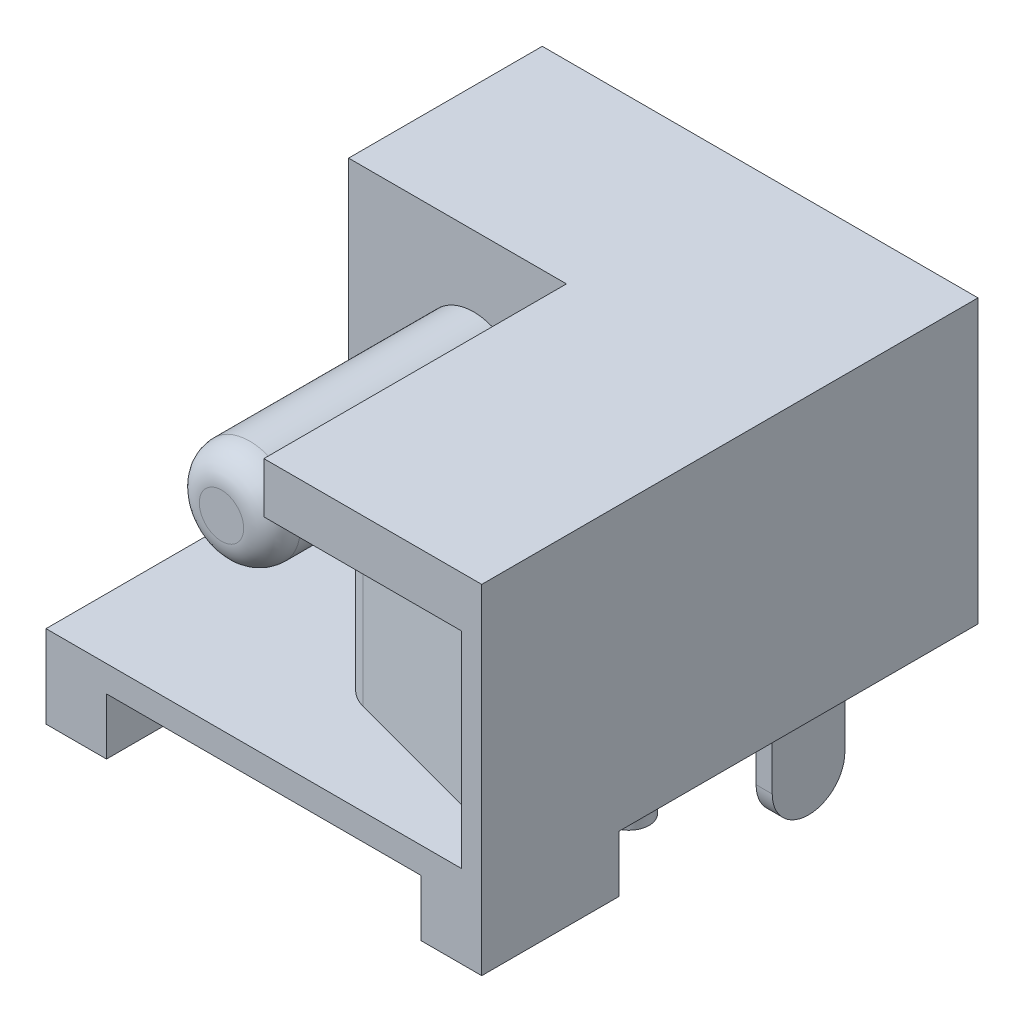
ISO-10303-21;
HEADER;
FILE_DESCRIPTION(('STEP AP214'),'2;1');
FILE_NAME('part.step','',(''),(''),'','','');
FILE_SCHEMA(('AUTOMOTIVE_DESIGN { 1 0 10303 214 1 1 1 1 }'));
ENDSEC;
DATA;
#1=APPLICATION_CONTEXT('core data for automotive mechanical design processes');
#2=APPLICATION_PROTOCOL_DEFINITION('international standard','automotive_design',2000,#1);
#3=PRODUCT_CONTEXT('',#1,'mechanical');
#4=PRODUCT('Part','Part','',(#3));
#5=PRODUCT_RELATED_PRODUCT_CATEGORY('part','',(#4));
#6=PRODUCT_DEFINITION_FORMATION('','',#4);
#7=PRODUCT_DEFINITION_CONTEXT('part definition',#1,'design');
#8=PRODUCT_DEFINITION('design','',#6,#7);
#9=PRODUCT_DEFINITION_SHAPE('','',#8);
#10=(LENGTH_UNIT() NAMED_UNIT(*) SI_UNIT(.MILLI.,.METRE.));
#11=(NAMED_UNIT(*) PLANE_ANGLE_UNIT() SI_UNIT($,.RADIAN.));
#12=(NAMED_UNIT(*) SI_UNIT($,.STERADIAN.) SOLID_ANGLE_UNIT());
#13=UNCERTAINTY_MEASURE_WITH_UNIT(LENGTH_MEASURE(1.E-05),#10,'distance_accuracy_value','');
#14=(GEOMETRIC_REPRESENTATION_CONTEXT(3) GLOBAL_UNCERTAINTY_ASSIGNED_CONTEXT((#13)) GLOBAL_UNIT_ASSIGNED_CONTEXT((#10,
#11,#12)) REPRESENTATION_CONTEXT('',''));
#15=CARTESIAN_POINT('',(0.,0.,0.));
#16=DIRECTION('',(0.,0.,1.));
#17=DIRECTION('',(1.,0.,0.));
#18=AXIS2_PLACEMENT_3D('',#15,#16,#17);
#19=CARTESIAN_POINT('',(-5.4,0.800000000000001,-12.3));
#20=DIRECTION('',(0.,0.,1.));
#21=DIRECTION('',(1.,0.,0.));
#22=AXIS2_PLACEMENT_3D('',#19,#20,#21);
#23=PLANE('',#22);
#24=DIRECTION('',(1.,0.,0.));
#25=VECTOR('',#24,1.);
#26=CARTESIAN_POINT('',(-5.4,0.800000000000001,-12.3));
#27=LINE('',#26,#25);
#28=CARTESIAN_POINT('',(-5.4,0.8,-12.3));
#29=VERTEX_POINT('',#28);
#30=CARTESIAN_POINT('',(5.4,0.799999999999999,-12.3));
#31=VERTEX_POINT('',#30);
#32=EDGE_CURVE('E361',#29,#31,#27,.T.);
#33=ORIENTED_EDGE('',*,*,#32,.F.);
#34=DIRECTION('',(0.,1.,0.));
#35=VECTOR('',#34,1.);
#36=CARTESIAN_POINT('',(-5.4,0.800000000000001,-12.3));
#37=LINE('',#36,#35);
#38=CARTESIAN_POINT('',(-5.4,7.8,-12.3));
#39=VERTEX_POINT('',#38);
#40=EDGE_CURVE('E465',#39,#29,#37,.F.);
#41=ORIENTED_EDGE('',*,*,#40,.F.);
#42=DIRECTION('',(1.,0.,0.));
#43=VECTOR('',#42,1.);
#44=CARTESIAN_POINT('',(-5.4,7.8,-12.3));
#45=LINE('',#44,#43);
#46=CARTESIAN_POINT('',(5.4,7.8,-12.3));
#47=VERTEX_POINT('',#46);
#48=EDGE_CURVE('E462',#47,#39,#45,.F.);
#49=ORIENTED_EDGE('',*,*,#48,.F.);
#50=DIRECTION('',(0.,1.,0.));
#51=VECTOR('',#50,1.);
#52=CARTESIAN_POINT('',(5.4,0.8,-12.3));
#53=LINE('',#52,#51);
#54=EDGE_CURVE('E466',#31,#47,#53,.T.);
#55=ORIENTED_EDGE('',*,*,#54,.F.);
#56=EDGE_LOOP('',(#33,#41,#49,#55));
#57=FACE_BOUND('',#56,.T.);
#58=ADVANCED_FACE('F30',(#57),#23,.F.);
#59=CARTESIAN_POINT('',(-2.3,4.8,-1.25));
#60=DIRECTION('',(0.,0.,1.));
#61=DIRECTION('',(1.,0.,0.));
#62=AXIS2_PLACEMENT_3D('',#59,#60,#61);
#63=PLANE('',#62);
#64=CARTESIAN_POINT('',(-2.3,4.8,-1.25));
#65=DIRECTION('',(0.,0.,-1.));
#66=DIRECTION('',(-1.,0.,0.));
#67=AXIS2_PLACEMENT_3D('',#64,#65,#66);
#68=CIRCLE('',#67,0.55);
#69=CARTESIAN_POINT('',(-2.85,4.8,-1.25));
#70=VERTEX_POINT('',#69);
#71=CARTESIAN_POINT('',(-1.75,4.8,-1.25));
#72=VERTEX_POINT('',#71);
#73=EDGE_CURVE('E688',#70,#72,#68,.T.);
#74=ORIENTED_EDGE('',*,*,#73,.F.);
#75=CARTESIAN_POINT('',(-2.3,4.8,-1.25));
#76=DIRECTION('',(0.,0.,-1.));
#77=DIRECTION('',(1.,0.,0.));
#78=AXIS2_PLACEMENT_3D('',#75,#76,#77);
#79=CIRCLE('',#78,0.55);
#80=EDGE_CURVE('E689',#72,#70,#79,.T.);
#81=ORIENTED_EDGE('',*,*,#80,.F.);
#82=EDGE_LOOP('',(#74,#81));
#83=FACE_BOUND('',#82,.T.);
#84=ADVANCED_FACE('F32',(#83),#63,.T.);
#85=CARTESIAN_POINT('',(0.46155033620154,1.45,-3.22455518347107));
#86=DIRECTION('',(0.,1.,0.));
#87=DIRECTION('',(0.,0.,-1.));
#88=AXIS2_PLACEMENT_3D('',#85,#86,#87);
#89=CYLINDRICAL_SURFACE('',#88,1.);
#90=CARTESIAN_POINT('',(0.46155033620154,6.55,-3.22455518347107));
#91=DIRECTION('',(0.,1.,0.));
#92=DIRECTION('',(0.,0.,-1.));
#93=AXIS2_PLACEMENT_3D('',#90,#91,#92);
#94=CIRCLE('',#93,1.);
#95=CARTESIAN_POINT('',(-0.523257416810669,6.55,-3.398203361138));
#96=VERTEX_POINT('',#95);
#97=CARTESIAN_POINT('',(0.,6.55,-2.33744116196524));
#98=VERTEX_POINT('',#97);
#99=EDGE_CURVE('E194',#96,#98,#94,.T.);
#100=ORIENTED_EDGE('',*,*,#99,.F.);
#101=DIRECTION('',(0.,1.,0.));
#102=VECTOR('',#101,1.);
#103=CARTESIAN_POINT('',(-0.523257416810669,1.45,-3.398203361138));
#104=LINE('',#103,#102);
#105=CARTESIAN_POINT('',(-0.523257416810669,1.45,-3.398203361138));
#106=VERTEX_POINT('',#105);
#107=EDGE_CURVE('E181',#106,#96,#104,.T.);
#108=ORIENTED_EDGE('',*,*,#107,.F.);
#109=CARTESIAN_POINT('',(0.46155033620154,1.45,-3.22455518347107));
#110=DIRECTION('',(0.,1.,0.));
#111=DIRECTION('',(0.,0.,-1.));
#112=AXIS2_PLACEMENT_3D('',#109,#110,#111);
#113=CIRCLE('',#112,1.);
#114=CARTESIAN_POINT('',(0.202731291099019,1.45,-2.258629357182));
#115=VERTEX_POINT('',#114);
#116=EDGE_CURVE('E175',#106,#115,#113,.T.);
#117=ORIENTED_EDGE('',*,*,#116,.T.);
#118=DIRECTION('',(0.,1.,0.));
#119=VECTOR('',#118,1.);
#120=CARTESIAN_POINT('',(0.202731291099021,6.55,-2.258629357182));
#121=LINE('',#120,#119);
#122=CARTESIAN_POINT('',(0.202731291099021,6.55,-2.258629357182));
#123=VERTEX_POINT('',#122);
#124=EDGE_CURVE('E178',#123,#115,#121,.F.);
#125=ORIENTED_EDGE('',*,*,#124,.F.);
#126=CARTESIAN_POINT('',(0.46155033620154,6.55,-3.22455518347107));
#127=DIRECTION('',(0.,1.,0.));
#128=DIRECTION('',(0.,0.,-1.));
#129=AXIS2_PLACEMENT_3D('',#126,#127,#128);
#130=CIRCLE('',#129,1.);
#131=EDGE_CURVE('E185',#123,#98,#130,.F.);
#132=ORIENTED_EDGE('',*,*,#131,.T.);
#133=EDGE_LOOP('',(#100,#108,#117,#125,#132));
#134=FACE_BOUND('',#133,.T.);
#135=ADVANCED_FACE('F177',(#134),#89,.T.);
#136=CARTESIAN_POINT('',(-1.75,4.8,-1.95));
#137=DIRECTION('',(0.,1.,0.));
#138=DIRECTION('',(1.,0.,0.));
#139=AXIS2_PLACEMENT_3D('',#136,#137,#138);
#140=CIRCLE('',#139,0.7);
#141=TRIMMED_CURVE('',#140,(PARAMETER_VALUE(-2.47464630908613)),
(PARAMETER_VALUE(2.47464630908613)),.T.,.PARAMETER.);
#142=CARTESIAN_POINT('',(-2.3,4.8,-1.95));
#143=DIRECTION('',(0.,0.,1.));
#144=AXIS1_PLACEMENT('',#142,#143);
#145=SURFACE_OF_REVOLUTION('',#141,#144);
#146=ORIENTED_EDGE('',*,*,#80,.T.);
#147=ORIENTED_EDGE('',*,*,#73,.T.);
#148=EDGE_LOOP('',(#146,#147));
#149=FACE_BOUND('',#148,.T.);
#150=CARTESIAN_POINT('',(-2.3,4.8,-1.95));
#151=DIRECTION('',(0.,0.,-1.));
#152=DIRECTION('',(-1.,0.,0.));
#153=AXIS2_PLACEMENT_3D('',#150,#151,#152);
#154=CIRCLE('',#153,1.25);
#155=CARTESIAN_POINT('',(-3.55,4.8,-1.95));
#156=VERTEX_POINT('',#155);
#157=EDGE_CURVE('E290',#156,#156,#154,.T.);
#158=ORIENTED_EDGE('',*,*,#157,.F.);
#159=EDGE_LOOP('',(#158));
#160=FACE_BOUND('',#159,.T.);
#161=ADVANCED_FACE('F324',(#149,#160),#145,.F.);
#162=CARTESIAN_POINT('',(0.200000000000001,6.55,-7.5));
#163=DIRECTION('',(0.,1.,0.));
#164=DIRECTION('',(0.,0.,-1.));
#165=AXIS2_PLACEMENT_3D('',#162,#163,#164);
#166=PLANE('',#165);
#167=ORIENTED_EDGE('',*,*,#99,.T.);
#168=DIRECTION('',(0.,0.,1.));
#169=VECTOR('',#168,1.);
#170=CARTESIAN_POINT('',(0.,6.55,-7.5));
#171=LINE('',#170,#169);
#172=CARTESIAN_POINT('',(0.,6.55,-6.36574363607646));
#173=VERTEX_POINT('',#172);
#174=EDGE_CURVE('E286',#98,#173,#171,.F.);
#175=ORIENTED_EDGE('',*,*,#174,.T.);
#176=DIRECTION('',(-0.173648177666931,0.,0.984807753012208));
#177=VECTOR('',#176,1.);
#178=CARTESIAN_POINT('',(0.200000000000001,6.55,-7.5));
#179=LINE('',#178,#177);
#180=EDGE_CURVE('E260',#96,#173,#179,.F.);
#181=ORIENTED_EDGE('',*,*,#180,.F.);
#182=EDGE_LOOP('',(#167,#175,#181));
#183=FACE_BOUND('',#182,.T.);
#184=ADVANCED_FACE('F328',(#183),#166,.T.);
#185=CARTESIAN_POINT('',(4.9,6.55,-1.));
#186=DIRECTION('',(-0.258819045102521,0.,0.965925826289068));
#187=DIRECTION('',(0.965925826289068,0.,0.258819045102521));
#188=AXIS2_PLACEMENT_3D('',#185,#186,#187);
#189=PLANE('',#188);
#190=DIRECTION('',(0.965925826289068,0.,0.258819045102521));
#191=VECTOR('',#190,1.);
#192=CARTESIAN_POINT('',(0.202731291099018,1.45,-2.258629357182));
#193=LINE('',#192,#191);
#194=CARTESIAN_POINT('',(4.9,1.45,-1.));
#195=VERTEX_POINT('',#194);
#196=EDGE_CURVE('E191',#115,#195,#193,.T.);
#197=ORIENTED_EDGE('',*,*,#196,.T.);
#198=DIRECTION('',(0.,1.,0.));
#199=VECTOR('',#198,1.);
#200=CARTESIAN_POINT('',(4.9,6.55,-1.));
#201=LINE('',#200,#199);
#202=CARTESIAN_POINT('',(4.9,6.55,-1.));
#203=VERTEX_POINT('',#202);
#204=EDGE_CURVE('E205',#195,#203,#201,.T.);
#205=ORIENTED_EDGE('',*,*,#204,.T.);
#206=DIRECTION('',(-0.965925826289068,0.,-0.258819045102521));
#207=VECTOR('',#206,1.);
#208=CARTESIAN_POINT('',(4.9,6.55,-1.));
#209=LINE('',#208,#207);
#210=EDGE_CURVE('E193',#203,#123,#209,.T.);
#211=ORIENTED_EDGE('',*,*,#210,.T.);
#212=ORIENTED_EDGE('',*,*,#124,.T.);
#213=EDGE_LOOP('',(#197,#205,#211,#212));
#214=FACE_BOUND('',#213,.T.);
#215=ADVANCED_FACE('F189',(#214),#189,.T.);
#216=CARTESIAN_POINT('',(0.199999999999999,1.45,-7.5));
#217=DIRECTION('',(-0.984807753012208,0.,-0.173648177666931));
#218=DIRECTION('',(-0.173648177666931,0.,0.984807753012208));
#219=AXIS2_PLACEMENT_3D('',#216,#217,#218);
#220=PLANE('',#219);
#221=DIRECTION('',(0.173648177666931,0.,-0.984807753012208));
#222=VECTOR('',#221,1.);
#223=CARTESIAN_POINT('',(0.,6.55,-6.36574363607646));
#224=LINE('',#223,#222);
#225=CARTESIAN_POINT('',(0.200000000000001,6.55,-7.5));
#226=VERTEX_POINT('',#225);
#227=EDGE_CURVE('E310',#173,#226,#224,.T.);
#228=ORIENTED_EDGE('',*,*,#227,.T.);
#229=DIRECTION('',(0.,1.,0.));
#230=VECTOR('',#229,1.);
#231=CARTESIAN_POINT('',(0.199999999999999,1.45,-7.5));
#232=LINE('',#231,#230);
#233=CARTESIAN_POINT('',(0.200000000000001,1.45,-7.5));
#234=VERTEX_POINT('',#233);
#235=EDGE_CURVE('E261',#234,#226,#232,.T.);
#236=ORIENTED_EDGE('',*,*,#235,.F.);
#237=DIRECTION('',(-0.173648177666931,0.,0.984807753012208));
#238=VECTOR('',#237,1.);
#239=CARTESIAN_POINT('',(0.199999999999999,1.45,-7.5));
#240=LINE('',#239,#238);
#241=EDGE_CURVE('E201',#234,#106,#240,.T.);
#242=ORIENTED_EDGE('',*,*,#241,.T.);
#243=ORIENTED_EDGE('',*,*,#107,.T.);
#244=ORIENTED_EDGE('',*,*,#180,.T.);
#245=EDGE_LOOP('',(#228,#236,#242,#243,#244));
#246=FACE_BOUND('',#245,.T.);
#247=ADVANCED_FACE('F754',(#246),#220,.T.);
#248=CARTESIAN_POINT('',(0.200000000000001,6.55,-7.5));
#249=DIRECTION('',(0.,1.,0.));
#250=DIRECTION('',(0.,0.,-1.));
#251=AXIS2_PLACEMENT_3D('',#248,#249,#250);
#252=PLANE('',#251);
#253=DIRECTION('',(0.,0.,1.));
#254=VECTOR('',#253,1.);
#255=CARTESIAN_POINT('',(0.,6.55,-7.5));
#256=LINE('',#255,#254);
#257=CARTESIAN_POINT('',(0.,6.55,-7.5));
#258=VERTEX_POINT('',#257);
#259=EDGE_CURVE('E289',#173,#258,#256,.F.);
#260=ORIENTED_EDGE('',*,*,#259,.T.);
#261=DIRECTION('',(1.,0.,0.));
#262=VECTOR('',#261,1.);
#263=CARTESIAN_POINT('',(-5.4,6.55,-7.5));
#264=LINE('',#263,#262);
#265=EDGE_CURVE('E264',#226,#258,#264,.F.);
#266=ORIENTED_EDGE('',*,*,#265,.F.);
#267=ORIENTED_EDGE('',*,*,#227,.F.);
#268=EDGE_LOOP('',(#260,#266,#267));
#269=FACE_BOUND('',#268,.T.);
#270=ADVANCED_FACE('F720',(#269),#252,.F.);
#271=CARTESIAN_POINT('',(-2.3,4.8,-1.25));
#272=DIRECTION('',(0.,0.,-1.));
#273=DIRECTION('',(-1.,0.,0.));
#274=AXIS2_PLACEMENT_3D('',#271,#272,#273);
#275=CYLINDRICAL_SURFACE('',#274,1.25);
#276=CARTESIAN_POINT('',(-2.3,4.8,-7.5));
#277=DIRECTION('',(0.,0.,-1.));
#278=DIRECTION('',(-1.,0.,0.));
#279=AXIS2_PLACEMENT_3D('',#276,#277,#278);
#280=CIRCLE('',#279,1.25);
#281=CARTESIAN_POINT('',(-3.55,4.8,-7.5));
#282=VERTEX_POINT('',#281);
#283=EDGE_CURVE('E300',#282,#282,#280,.T.);
#284=ORIENTED_EDGE('',*,*,#283,.F.);
#285=EDGE_LOOP('',(#284));
#286=FACE_BOUND('',#285,.T.);
#287=ORIENTED_EDGE('',*,*,#157,.T.);
#288=EDGE_LOOP('',(#287));
#289=FACE_BOUND('',#288,.T.);
#290=ADVANCED_FACE('F870',(#286,#289),#275,.T.);
#291=CARTESIAN_POINT('',(0.,7.8,-7.5));
#292=DIRECTION('',(1.,0.,0.));
#293=DIRECTION('',(0.,1.,0.));
#294=AXIS2_PLACEMENT_3D('',#291,#292,#293);
#295=PLANE('',#294);
#296=DIRECTION('',(0.,1.,0.));
#297=VECTOR('',#296,1.);
#298=CARTESIAN_POINT('',(0.,7.8,0.));
#299=LINE('',#298,#297);
#300=CARTESIAN_POINT('',(0.,7.8,0.));
#301=VERTEX_POINT('',#300);
#302=CARTESIAN_POINT('',(0.,6.55,0.));
#303=VERTEX_POINT('',#302);
#304=EDGE_CURVE('E246',#301,#303,#299,.F.);
#305=ORIENTED_EDGE('',*,*,#304,.F.);
#306=DIRECTION('',(0.,0.,1.));
#307=VECTOR('',#306,1.);
#308=CARTESIAN_POINT('',(0.,7.8,-12.3));
#309=LINE('',#308,#307);
#310=CARTESIAN_POINT('',(0.,7.8,-7.5));
#311=VERTEX_POINT('',#310);
#312=EDGE_CURVE('E296',#311,#301,#309,.T.);
#313=ORIENTED_EDGE('',*,*,#312,.F.);
#314=DIRECTION('',(0.,1.,0.));
#315=VECTOR('',#314,1.);
#316=CARTESIAN_POINT('',(0.,1.45,-7.5));
#317=LINE('',#316,#315);
#318=EDGE_CURVE('E209',#258,#311,#317,.T.);
#319=ORIENTED_EDGE('',*,*,#318,.F.);
#320=ORIENTED_EDGE('',*,*,#259,.F.);
#321=ORIENTED_EDGE('',*,*,#174,.F.);
#322=DIRECTION('',(0.,0.,-1.));
#323=VECTOR('',#322,1.);
#324=CARTESIAN_POINT('',(0.,6.55,-7.5));
#325=LINE('',#324,#323);
#326=EDGE_CURVE('E215',#98,#303,#325,.F.);
#327=ORIENTED_EDGE('',*,*,#326,.T.);
#328=EDGE_LOOP('',(#305,#313,#319,#320,#321,#327));
#329=FACE_BOUND('',#328,.T.);
#330=ADVANCED_FACE('F724',(#329),#295,.F.);
#331=CARTESIAN_POINT('',(-0.0500000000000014,0.,-9.5));
#332=DIRECTION('',(0.,-1.,0.));
#333=DIRECTION('',(1.,0.,0.));
#334=AXIS2_PLACEMENT_3D('',#331,#332,#333);
#335=PLANE('',#334);
#336=CARTESIAN_POINT('',(-0.0500000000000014,0.,-9.5));
#337=DIRECTION('',(0.,1.,0.));
#338=DIRECTION('',(-1.,0.,0.));
#339=AXIS2_PLACEMENT_3D('',#336,#337,#338);
#340=CIRCLE('',#339,0.5);
#341=CARTESIAN_POINT('',(-0.550000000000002,0.,-9.5));
#342=VERTEX_POINT('',#341);
#343=EDGE_CURVE('E548',#342,#342,#340,.T.);
#344=ORIENTED_EDGE('',*,*,#343,.F.);
#345=EDGE_LOOP('',(#344));
#346=FACE_BOUND('',#345,.T.);
#347=ADVANCED_FACE('F886',(#346),#335,.T.);
#348=CARTESIAN_POINT('',(3.3,-2.9,-10.7));
#349=DIRECTION('',(0.,0.,1.));
#350=DIRECTION('',(1.,0.,0.));
#351=AXIS2_PLACEMENT_3D('',#348,#349,#350);
#352=PLANE('',#351);
#353=DIRECTION('',(-1.,0.,0.));
#354=VECTOR('',#353,1.);
#355=CARTESIAN_POINT('',(3.7,-2.,-10.7));
#356=LINE('',#355,#354);
#357=CARTESIAN_POINT('',(3.3,-2.,-10.7));
#358=VERTEX_POINT('',#357);
#359=CARTESIAN_POINT('',(3.7,-2.,-10.7));
#360=VERTEX_POINT('',#359);
#361=EDGE_CURVE('E227',#358,#360,#356,.F.);
#362=ORIENTED_EDGE('',*,*,#361,.F.);
#363=DIRECTION('',(0.,1.,0.));
#364=VECTOR('',#363,1.);
#365=CARTESIAN_POINT('',(3.3,-2.9,-10.7));
#366=LINE('',#365,#364);
#367=CARTESIAN_POINT('',(3.3,0.800000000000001,-10.7));
#368=VERTEX_POINT('',#367);
#369=EDGE_CURVE('E532',#358,#368,#366,.T.);
#370=ORIENTED_EDGE('',*,*,#369,.T.);
#371=DIRECTION('',(1.,0.,0.));
#372=VECTOR('',#371,1.);
#373=CARTESIAN_POINT('',(3.3,0.8,-10.7));
#374=LINE('',#373,#372);
#375=CARTESIAN_POINT('',(3.7,0.800000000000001,-10.7));
#376=VERTEX_POINT('',#375);
#377=EDGE_CURVE('E235',#376,#368,#374,.F.);
#378=ORIENTED_EDGE('',*,*,#377,.F.);
#379=DIRECTION('',(0.,1.,0.));
#380=VECTOR('',#379,1.);
#381=CARTESIAN_POINT('',(3.7,-2.9,-10.7));
#382=LINE('',#381,#380);
#383=EDGE_CURVE('E545',#376,#360,#382,.F.);
#384=ORIENTED_EDGE('',*,*,#383,.T.);
#385=EDGE_LOOP('',(#362,#370,#378,#384));
#386=FACE_BOUND('',#385,.T.);
#387=ADVANCED_FACE('F894',(#386),#352,.F.);
#388=CARTESIAN_POINT('',(3.3,-2.9,-8.9));
#389=DIRECTION('',(0.,0.,-1.));
#390=DIRECTION('',(-1.,0.,0.));
#391=AXIS2_PLACEMENT_3D('',#388,#389,#390);
#392=PLANE('',#391);
#393=DIRECTION('',(1.,0.,0.));
#394=VECTOR('',#393,1.);
#395=CARTESIAN_POINT('',(3.7,-2.,-8.9));
#396=LINE('',#395,#394);
#397=CARTESIAN_POINT('',(3.7,-2.,-8.9));
#398=VERTEX_POINT('',#397);
#399=CARTESIAN_POINT('',(3.3,-2.,-8.9));
#400=VERTEX_POINT('',#399);
#401=EDGE_CURVE('E230',#398,#400,#396,.F.);
#402=ORIENTED_EDGE('',*,*,#401,.F.);
#403=DIRECTION('',(0.,1.,0.));
#404=VECTOR('',#403,1.);
#405=CARTESIAN_POINT('',(3.7,-2.9,-8.9));
#406=LINE('',#405,#404);
#407=CARTESIAN_POINT('',(3.7,0.800000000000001,-8.9));
#408=VERTEX_POINT('',#407);
#409=EDGE_CURVE('E537',#398,#408,#406,.T.);
#410=ORIENTED_EDGE('',*,*,#409,.T.);
#411=DIRECTION('',(-1.,0.,0.));
#412=VECTOR('',#411,1.);
#413=CARTESIAN_POINT('',(3.3,0.8,-8.9));
#414=LINE('',#413,#412);
#415=CARTESIAN_POINT('',(3.3,0.800000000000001,-8.9));
#416=VERTEX_POINT('',#415);
#417=EDGE_CURVE('E233',#416,#408,#414,.F.);
#418=ORIENTED_EDGE('',*,*,#417,.F.);
#419=DIRECTION('',(0.,1.,0.));
#420=VECTOR('',#419,1.);
#421=CARTESIAN_POINT('',(3.3,-2.9,-8.9));
#422=LINE('',#421,#420);
#423=EDGE_CURVE('E529',#416,#400,#422,.F.);
#424=ORIENTED_EDGE('',*,*,#423,.T.);
#425=EDGE_LOOP('',(#402,#410,#418,#424));
#426=FACE_BOUND('',#425,.T.);
#427=ADVANCED_FACE('F903',(#426),#392,.F.);
#428=CARTESIAN_POINT('',(3.7,-2.,-9.8));
#429=DIRECTION('',(-1.,0.,0.));
#430=DIRECTION('',(0.,0.,1.));
#431=AXIS2_PLACEMENT_3D('',#428,#429,#430);
#432=CYLINDRICAL_SURFACE('',#431,0.9);
#433=ORIENTED_EDGE('',*,*,#361,.T.);
#434=CARTESIAN_POINT('',(3.7,-2.,-9.8));
#435=DIRECTION('',(1.,0.,0.));
#436=DIRECTION('',(0.,0.,-1.));
#437=AXIS2_PLACEMENT_3D('',#434,#435,#436);
#438=CIRCLE('',#437,0.9);
#439=EDGE_CURVE('E542',#360,#398,#438,.F.);
#440=ORIENTED_EDGE('',*,*,#439,.T.);
#441=ORIENTED_EDGE('',*,*,#401,.T.);
#442=CARTESIAN_POINT('',(3.3,-2.,-9.8));
#443=DIRECTION('',(-1.,0.,0.));
#444=DIRECTION('',(0.,0.,1.));
#445=AXIS2_PLACEMENT_3D('',#442,#443,#444);
#446=CIRCLE('',#445,0.9);
#447=EDGE_CURVE('E526',#400,#358,#446,.F.);
#448=ORIENTED_EDGE('',*,*,#447,.T.);
#449=EDGE_LOOP('',(#433,#440,#441,#448));
#450=FACE_BOUND('',#449,.T.);
#451=ADVANCED_FACE('F912',(#450),#432,.T.);
#452=CARTESIAN_POINT('',(-5.4,-0.599999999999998,-3.5));
#453=DIRECTION('',(0.,1.,0.));
#454=DIRECTION('',(-1.,0.,0.));
#455=AXIS2_PLACEMENT_3D('',#452,#453,#454);
#456=PLANE('',#455);
#457=DIRECTION('',(0.,0.,1.));
#458=VECTOR('',#457,1.);
#459=CARTESIAN_POINT('',(5.4,-0.599999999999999,-12.3));
#460=LINE('',#459,#458);
#461=CARTESIAN_POINT('',(5.4,-0.599999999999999,0.));
#462=VERTEX_POINT('',#461);
#463=CARTESIAN_POINT('',(5.4,-0.599999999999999,-3.4));
#464=VERTEX_POINT('',#463);
#465=EDGE_CURVE('E518',#462,#464,#460,.F.);
#466=ORIENTED_EDGE('',*,*,#465,.F.);
#467=DIRECTION('',(-1.,0.,0.));
#468=VECTOR('',#467,1.);
#469=CARTESIAN_POINT('',(-5.4,-0.599999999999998,0.));
#470=LINE('',#469,#468);
#471=CARTESIAN_POINT('',(3.9,-0.599999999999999,0.));
#472=VERTEX_POINT('',#471);
#473=EDGE_CURVE('E222',#472,#462,#470,.F.);
#474=ORIENTED_EDGE('',*,*,#473,.F.);
#475=DIRECTION('',(0.,0.,-1.));
#476=VECTOR('',#475,1.);
#477=CARTESIAN_POINT('',(3.9,-0.599999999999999,-3.4));
#478=LINE('',#477,#476);
#479=CARTESIAN_POINT('',(3.9,-0.599999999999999,-3.4));
#480=VERTEX_POINT('',#479);
#481=EDGE_CURVE('E511',#472,#480,#478,.T.);
#482=ORIENTED_EDGE('',*,*,#481,.T.);
#483=DIRECTION('',(1.,0.,0.));
#484=VECTOR('',#483,1.);
#485=CARTESIAN_POINT('',(5.4,-0.599999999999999,-3.4));
#486=LINE('',#485,#484);
#487=EDGE_CURVE('E515',#480,#464,#486,.T.);
#488=ORIENTED_EDGE('',*,*,#487,.T.);
#489=EDGE_LOOP('',(#466,#474,#482,#488));
#490=FACE_BOUND('',#489,.T.);
#491=ADVANCED_FACE('F770',(#490),#456,.F.);
#492=CARTESIAN_POINT('',(0.200000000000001,6.55,-7.5));
#493=DIRECTION('',(0.,1.,0.));
#494=DIRECTION('',(0.,0.,-1.));
#495=AXIS2_PLACEMENT_3D('',#492,#493,#494);
#496=PLANE('',#495);
#497=ORIENTED_EDGE('',*,*,#131,.F.);
#498=ORIENTED_EDGE('',*,*,#210,.F.);
#499=DIRECTION('',(0.,0.,1.));
#500=VECTOR('',#499,1.);
#501=CARTESIAN_POINT('',(4.9,6.55,-8.07248188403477));
#502=LINE('',#501,#500);
#503=CARTESIAN_POINT('',(4.9,6.55,0.));
#504=VERTEX_POINT('',#503);
#505=EDGE_CURVE('E218',#203,#504,#502,.T.);
#506=ORIENTED_EDGE('',*,*,#505,.T.);
#507=DIRECTION('',(1.,0.,0.));
#508=VECTOR('',#507,1.);
#509=CARTESIAN_POINT('',(-5.4,6.55,0.));
#510=LINE('',#509,#508);
#511=EDGE_CURVE('E278',#303,#504,#510,.T.);
#512=ORIENTED_EDGE('',*,*,#511,.F.);
#513=ORIENTED_EDGE('',*,*,#326,.F.);
#514=EDGE_LOOP('',(#497,#498,#506,#512,#513));
#515=FACE_BOUND('',#514,.T.);
#516=ADVANCED_FACE('F758',(#515),#496,.F.);
#517=CARTESIAN_POINT('',(4.9,6.55,-8.07248188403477));
#518=DIRECTION('',(1.,0.,0.));
#519=DIRECTION('',(0.,1.,0.));
#520=AXIS2_PLACEMENT_3D('',#517,#518,#519);
#521=PLANE('',#520);
#522=DIRECTION('',(0.,0.,1.));
#523=VECTOR('',#522,1.);
#524=CARTESIAN_POINT('',(4.9,1.45,-7.5));
#525=LINE('',#524,#523);
#526=CARTESIAN_POINT('',(4.9,1.45,0.));
#527=VERTEX_POINT('',#526);
#528=EDGE_CURVE('E200',#195,#527,#525,.T.);
#529=ORIENTED_EDGE('',*,*,#528,.T.);
#530=DIRECTION('',(0.,1.,0.));
#531=VECTOR('',#530,1.);
#532=CARTESIAN_POINT('',(4.9,0.8,0.));
#533=LINE('',#532,#531);
#534=EDGE_CURVE('E274',#504,#527,#533,.F.);
#535=ORIENTED_EDGE('',*,*,#534,.F.);
#536=ORIENTED_EDGE('',*,*,#505,.F.);
#537=ORIENTED_EDGE('',*,*,#204,.F.);
#538=EDGE_LOOP('',(#529,#535,#536,#537));
#539=FACE_BOUND('',#538,.T.);
#540=ADVANCED_FACE('F762',(#539),#521,.F.);
#541=CARTESIAN_POINT('',(-5.4,-0.599999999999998,-3.5));
#542=DIRECTION('',(0.,1.,0.));
#543=DIRECTION('',(-1.,0.,0.));
#544=AXIS2_PLACEMENT_3D('',#541,#542,#543);
#545=PLANE('',#544);
#546=DIRECTION('',(1.,0.,0.));
#547=VECTOR('',#546,1.);
#548=CARTESIAN_POINT('',(-5.4,-0.599999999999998,0.));
#549=LINE('',#548,#547);
#550=CARTESIAN_POINT('',(-5.4,-0.599999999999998,0.));
#551=VERTEX_POINT('',#550);
#552=CARTESIAN_POINT('',(-3.9,-0.599999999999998,0.));
#553=VERTEX_POINT('',#552);
#554=EDGE_CURVE('E506',#551,#553,#549,.T.);
#555=ORIENTED_EDGE('',*,*,#554,.F.);
#556=DIRECTION('',(0.,0.,1.));
#557=VECTOR('',#556,1.);
#558=CARTESIAN_POINT('',(-5.4,-0.599999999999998,-12.3));
#559=LINE('',#558,#557);
#560=CARTESIAN_POINT('',(-5.4,-0.599999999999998,-3.4));
#561=VERTEX_POINT('',#560);
#562=EDGE_CURVE('E491',#561,#551,#559,.T.);
#563=ORIENTED_EDGE('',*,*,#562,.F.);
#564=DIRECTION('',(1.,0.,0.));
#565=VECTOR('',#564,1.);
#566=CARTESIAN_POINT('',(-5.4,-0.599999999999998,-3.4));
#567=LINE('',#566,#565);
#568=CARTESIAN_POINT('',(-3.9,-0.599999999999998,-3.4));
#569=VERTEX_POINT('',#568);
#570=EDGE_CURVE('E496',#561,#569,#567,.T.);
#571=ORIENTED_EDGE('',*,*,#570,.T.);
#572=DIRECTION('',(0.,0.,1.));
#573=VECTOR('',#572,1.);
#574=CARTESIAN_POINT('',(-3.9,-0.599999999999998,-3.4));
#575=LINE('',#574,#573);
#576=EDGE_CURVE('E306',#569,#553,#575,.T.);
#577=ORIENTED_EDGE('',*,*,#576,.T.);
#578=EDGE_LOOP('',(#555,#563,#571,#577));
#579=FACE_BOUND('',#578,.T.);
#580=ADVANCED_FACE('F745',(#579),#545,.F.);
#581=CARTESIAN_POINT('',(-5.4,1.45,-7.5));
#582=DIRECTION('',(0.,-1.,0.));
#583=DIRECTION('',(1.,0.,0.));
#584=AXIS2_PLACEMENT_3D('',#581,#582,#583);
#585=PLANE('',#584);
#586=ORIENTED_EDGE('',*,*,#528,.F.);
#587=ORIENTED_EDGE('',*,*,#196,.F.);
#588=ORIENTED_EDGE('',*,*,#116,.F.);
#589=ORIENTED_EDGE('',*,*,#241,.F.);
#590=DIRECTION('',(1.,0.,0.));
#591=VECTOR('',#590,1.);
#592=CARTESIAN_POINT('',(-5.4,1.45,-7.5));
#593=LINE('',#592,#591);
#594=CARTESIAN_POINT('',(-5.4,1.45,-7.5));
#595=VERTEX_POINT('',#594);
#596=EDGE_CURVE('E203',#595,#234,#593,.T.);
#597=ORIENTED_EDGE('',*,*,#596,.F.);
#598=DIRECTION('',(0.,0.,1.));
#599=VECTOR('',#598,1.);
#600=CARTESIAN_POINT('',(-5.4,1.45,-12.3));
#601=LINE('',#600,#599);
#602=CARTESIAN_POINT('',(-5.4,1.45,0.));
#603=VERTEX_POINT('',#602);
#604=EDGE_CURVE('E486',#603,#595,#601,.F.);
#605=ORIENTED_EDGE('',*,*,#604,.F.);
#606=DIRECTION('',(1.,0.,0.));
#607=VECTOR('',#606,1.);
#608=CARTESIAN_POINT('',(-5.4,1.45,0.));
#609=LINE('',#608,#607);
#610=EDGE_CURVE('E277',#527,#603,#609,.F.);
#611=ORIENTED_EDGE('',*,*,#610,.F.);
#612=EDGE_LOOP('',(#586,#587,#588,#589,#597,#605,#611));
#613=FACE_BOUND('',#612,.T.);
#614=ADVANCED_FACE('F197',(#613),#585,.F.);
#615=CARTESIAN_POINT('',(-5.4,1.45,-7.5));
#616=DIRECTION('',(0.,0.,1.));
#617=DIRECTION('',(1.,0.,0.));
#618=AXIS2_PLACEMENT_3D('',#615,#616,#617);
#619=PLANE('',#618);
#620=ORIENTED_EDGE('',*,*,#283,.T.);
#621=EDGE_LOOP('',(#620));
#622=FACE_BOUND('',#621,.T.);
#623=ORIENTED_EDGE('',*,*,#318,.T.);
#624=DIRECTION('',(-1.,0.,0.));
#625=VECTOR('',#624,1.);
#626=CARTESIAN_POINT('',(-5.4,7.8,-7.5));
#627=LINE('',#626,#625);
#628=CARTESIAN_POINT('',(-5.4,7.8,-7.5));
#629=VERTEX_POINT('',#628);
#630=EDGE_CURVE('E299',#629,#311,#627,.F.);
#631=ORIENTED_EDGE('',*,*,#630,.F.);
#632=DIRECTION('',(0.,-1.,0.));
#633=VECTOR('',#632,1.);
#634=CARTESIAN_POINT('',(-5.4,7.8,-7.5));
#635=LINE('',#634,#633);
#636=EDGE_CURVE('E387',#595,#629,#635,.F.);
#637=ORIENTED_EDGE('',*,*,#636,.F.);
#638=ORIENTED_EDGE('',*,*,#596,.T.);
#639=ORIENTED_EDGE('',*,*,#235,.T.);
#640=ORIENTED_EDGE('',*,*,#265,.T.);
#641=EDGE_LOOP('',(#623,#631,#637,#638,#639,#640));
#642=FACE_BOUND('',#641,.T.);
#643=ADVANCED_FACE('F385',(#622,#642),#619,.T.);
#644=CARTESIAN_POINT('',(-5.4,7.8,-12.3));
#645=DIRECTION('',(0.,1.,0.));
#646=DIRECTION('',(-1.,0.,0.));
#647=AXIS2_PLACEMENT_3D('',#644,#645,#646);
#648=PLANE('',#647);
#649=DIRECTION('',(0.,0.,1.));
#650=VECTOR('',#649,1.);
#651=CARTESIAN_POINT('',(-5.4,7.8,-12.3));
#652=LINE('',#651,#650);
#653=EDGE_CURVE('E379',#629,#39,#652,.F.);
#654=ORIENTED_EDGE('',*,*,#653,.F.);
#655=ORIENTED_EDGE('',*,*,#630,.T.);
#656=ORIENTED_EDGE('',*,*,#312,.T.);
#657=DIRECTION('',(1.,0.,0.));
#658=VECTOR('',#657,1.);
#659=CARTESIAN_POINT('',(-5.4,7.8,0.));
#660=LINE('',#659,#658);
#661=CARTESIAN_POINT('',(5.4,7.8,0.));
#662=VERTEX_POINT('',#661);
#663=EDGE_CURVE('E303',#662,#301,#660,.F.);
#664=ORIENTED_EDGE('',*,*,#663,.F.);
#665=DIRECTION('',(0.,0.,1.));
#666=VECTOR('',#665,1.);
#667=CARTESIAN_POINT('',(5.4,7.8,-12.3));
#668=LINE('',#667,#666);
#669=EDGE_CURVE('E463',#47,#662,#668,.T.);
#670=ORIENTED_EDGE('',*,*,#669,.F.);
#671=ORIENTED_EDGE('',*,*,#48,.T.);
#672=EDGE_LOOP('',(#654,#655,#656,#664,#670,#671));
#673=FACE_BOUND('',#672,.T.);
#674=ADVANCED_FACE('F373',(#673),#648,.T.);
#675=CARTESIAN_POINT('',(0.299999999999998,-2.9,-10.5));
#676=DIRECTION('',(0.,0.,-1.));
#677=DIRECTION('',(-1.,0.,0.));
#678=AXIS2_PLACEMENT_3D('',#675,#676,#677);
#679=PLANE('',#678);
#680=DIRECTION('',(1.,0.,0.));
#681=VECTOR('',#680,1.);
#682=CARTESIAN_POINT('',(0.699999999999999,-2.,-10.5));
#683=LINE('',#682,#681);
#684=CARTESIAN_POINT('',(0.699999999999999,-2.,-10.5));
#685=VERTEX_POINT('',#684);
#686=CARTESIAN_POINT('',(0.299999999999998,-2.,-10.5));
#687=VERTEX_POINT('',#686);
#688=EDGE_CURVE('E354',#685,#687,#683,.F.);
#689=ORIENTED_EDGE('',*,*,#688,.F.);
#690=DIRECTION('',(0.,1.,0.));
#691=VECTOR('',#690,1.);
#692=CARTESIAN_POINT('',(0.699999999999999,-2.9,-10.5));
#693=LINE('',#692,#691);
#694=CARTESIAN_POINT('',(0.699999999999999,0.800000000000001,-10.5));
#695=VERTEX_POINT('',#694);
#696=EDGE_CURVE('E523',#685,#695,#693,.T.);
#697=ORIENTED_EDGE('',*,*,#696,.T.);
#698=DIRECTION('',(-1.,0.,0.));
#699=VECTOR('',#698,1.);
#700=CARTESIAN_POINT('',(0.3,0.800000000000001,-10.5));
#701=LINE('',#700,#699);
#702=CARTESIAN_POINT('',(0.299999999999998,0.800000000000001,-10.5));
#703=VERTEX_POINT('',#702);
#704=EDGE_CURVE('E357',#703,#695,#701,.F.);
#705=ORIENTED_EDGE('',*,*,#704,.F.);
#706=DIRECTION('',(0.,1.,0.));
#707=VECTOR('',#706,1.);
#708=CARTESIAN_POINT('',(0.299999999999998,-2.9,-10.5));
#709=LINE('',#708,#707);
#710=EDGE_CURVE('E474',#703,#687,#709,.F.);
#711=ORIENTED_EDGE('',*,*,#710,.T.);
#712=EDGE_LOOP('',(#689,#697,#705,#711));
#713=FACE_BOUND('',#712,.T.);
#714=ADVANCED_FACE('F669',(#713),#679,.F.);
#715=CARTESIAN_POINT('',(0.699999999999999,-2.,-11.4));
#716=DIRECTION('',(-1.,0.,0.));
#717=DIRECTION('',(0.,0.,1.));
#718=AXIS2_PLACEMENT_3D('',#715,#716,#717);
#719=CYLINDRICAL_SURFACE('',#718,0.9);
#720=DIRECTION('',(1.,0.,0.));
#721=VECTOR('',#720,1.);
#722=CARTESIAN_POINT('',(-5.4,-2.,-12.3));
#723=LINE('',#722,#721);
#724=CARTESIAN_POINT('',(0.3,-2.,-12.3));
#725=VERTEX_POINT('',#724);
#726=CARTESIAN_POINT('',(0.699999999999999,-2.,-12.3));
#727=VERTEX_POINT('',#726);
#728=EDGE_CURVE('E352',#725,#727,#723,.T.);
#729=ORIENTED_EDGE('',*,*,#728,.T.);
#730=CARTESIAN_POINT('',(0.699999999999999,-2.,-11.4));
#731=DIRECTION('',(1.,0.,0.));
#732=DIRECTION('',(0.,0.,-1.));
#733=AXIS2_PLACEMENT_3D('',#730,#731,#732);
#734=CIRCLE('',#733,0.9);
#735=EDGE_CURVE('E520',#727,#685,#734,.F.);
#736=ORIENTED_EDGE('',*,*,#735,.T.);
#737=ORIENTED_EDGE('',*,*,#688,.T.);
#738=CARTESIAN_POINT('',(0.299999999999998,-2.,-11.4));
#739=DIRECTION('',(-1.,0.,0.));
#740=DIRECTION('',(0.,0.,1.));
#741=AXIS2_PLACEMENT_3D('',#738,#739,#740);
#742=CIRCLE('',#741,0.9);
#743=EDGE_CURVE('E477',#687,#725,#742,.F.);
#744=ORIENTED_EDGE('',*,*,#743,.T.);
#745=EDGE_LOOP('',(#729,#736,#737,#744));
#746=FACE_BOUND('',#745,.T.);
#747=ADVANCED_FACE('F674',(#746),#719,.T.);
#748=CARTESIAN_POINT('',(-4.4,-2.9,-11.6));
#749=DIRECTION('',(1.,0.,0.));
#750=DIRECTION('',(0.,0.,-1.));
#751=AXIS2_PLACEMENT_3D('',#748,#749,#750);
#752=PLANE('',#751);
#753=DIRECTION('',(0.,0.,1.));
#754=VECTOR('',#753,1.);
#755=CARTESIAN_POINT('',(-4.4,-2.,-11.6));
#756=LINE('',#755,#754);
#757=CARTESIAN_POINT('',(-4.4,-2.,-11.2));
#758=VERTEX_POINT('',#757);
#759=CARTESIAN_POINT('',(-4.4,-2.,-11.6));
#760=VERTEX_POINT('',#759);
#761=EDGE_CURVE('E551',#758,#760,#756,.F.);
#762=ORIENTED_EDGE('',*,*,#761,.F.);
#763=DIRECTION('',(0.,1.,0.));
#764=VECTOR('',#763,1.);
#765=CARTESIAN_POINT('',(-4.4,-2.9,-11.2));
#766=LINE('',#765,#764);
#767=CARTESIAN_POINT('',(-4.4,0.800000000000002,-11.2));
#768=VERTEX_POINT('',#767);
#769=EDGE_CURVE('E593',#758,#768,#766,.T.);
#770=ORIENTED_EDGE('',*,*,#769,.T.);
#771=DIRECTION('',(0.,0.,-1.));
#772=VECTOR('',#771,1.);
#773=CARTESIAN_POINT('',(-4.4,0.800000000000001,-11.6));
#774=LINE('',#773,#772);
#775=CARTESIAN_POINT('',(-4.4,0.800000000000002,-11.6));
#776=VERTEX_POINT('',#775);
#777=EDGE_CURVE('E58',#776,#768,#774,.F.);
#778=ORIENTED_EDGE('',*,*,#777,.F.);
#779=DIRECTION('',(0.,1.,0.));
#780=VECTOR('',#779,1.);
#781=CARTESIAN_POINT('',(-4.4,-2.9,-11.6));
#782=LINE('',#781,#780);
#783=EDGE_CURVE('E576',#776,#760,#782,.F.);
#784=ORIENTED_EDGE('',*,*,#783,.T.);
#785=EDGE_LOOP('',(#762,#770,#778,#784));
#786=FACE_BOUND('',#785,.T.);
#787=ADVANCED_FACE('F988',(#786),#752,.F.);
#788=CARTESIAN_POINT('',(-2.6,-2.9,-11.6));
#789=DIRECTION('',(-1.,0.,0.));
#790=DIRECTION('',(0.,0.,1.));
#791=AXIS2_PLACEMENT_3D('',#788,#789,#790);
#792=PLANE('',#791);
#793=DIRECTION('',(0.,0.,-1.));
#794=VECTOR('',#793,1.);
#795=CARTESIAN_POINT('',(-2.6,-2.,-11.6));
#796=LINE('',#795,#794);
#797=CARTESIAN_POINT('',(-2.6,-2.,-11.6));
#798=VERTEX_POINT('',#797);
#799=CARTESIAN_POINT('',(-2.6,-2.,-11.2));
#800=VERTEX_POINT('',#799);
#801=EDGE_CURVE('E554',#798,#800,#796,.F.);
#802=ORIENTED_EDGE('',*,*,#801,.F.);
#803=DIRECTION('',(0.,1.,0.));
#804=VECTOR('',#803,1.);
#805=CARTESIAN_POINT('',(-2.6,-2.9,-11.6));
#806=LINE('',#805,#804);
#807=CARTESIAN_POINT('',(-2.6,0.800000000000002,-11.6));
#808=VERTEX_POINT('',#807);
#809=EDGE_CURVE('E574',#798,#808,#806,.T.);
#810=ORIENTED_EDGE('',*,*,#809,.T.);
#811=DIRECTION('',(0.,0.,1.));
#812=VECTOR('',#811,1.);
#813=CARTESIAN_POINT('',(-2.6,0.800000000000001,-11.6));
#814=LINE('',#813,#812);
#815=CARTESIAN_POINT('',(-2.6,0.800000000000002,-11.2));
#816=VERTEX_POINT('',#815);
#817=EDGE_CURVE('E427',#816,#808,#814,.F.);
#818=ORIENTED_EDGE('',*,*,#817,.F.);
#819=DIRECTION('',(0.,1.,0.));
#820=VECTOR('',#819,1.);
#821=CARTESIAN_POINT('',(-2.6,-2.9,-11.2));
#822=LINE('',#821,#820);
#823=EDGE_CURVE('E597',#816,#800,#822,.F.);
#824=ORIENTED_EDGE('',*,*,#823,.T.);
#825=EDGE_LOOP('',(#802,#810,#818,#824));
#826=FACE_BOUND('',#825,.T.);
#827=ADVANCED_FACE('F997',(#826),#792,.F.);
#828=CARTESIAN_POINT('',(-3.5,-2.,-11.6));
#829=DIRECTION('',(0.,0.,1.));
#830=DIRECTION('',(1.,0.,0.));
#831=AXIS2_PLACEMENT_3D('',#828,#829,#830);
#832=CYLINDRICAL_SURFACE('',#831,0.9);
#833=ORIENTED_EDGE('',*,*,#761,.T.);
#834=CARTESIAN_POINT('',(-3.5,-2.,-11.6));
#835=DIRECTION('',(0.,0.,-1.));
#836=DIRECTION('',(-1.,0.,0.));
#837=AXIS2_PLACEMENT_3D('',#834,#835,#836);
#838=CIRCLE('',#837,0.9);
#839=EDGE_CURVE('E578',#760,#798,#838,.F.);
#840=ORIENTED_EDGE('',*,*,#839,.T.);
#841=ORIENTED_EDGE('',*,*,#801,.T.);
#842=CARTESIAN_POINT('',(-3.5,-2.,-11.2));
#843=DIRECTION('',(0.,0.,1.));
#844=DIRECTION('',(1.,0.,0.));
#845=AXIS2_PLACEMENT_3D('',#842,#843,#844);
#846=CIRCLE('',#845,0.9);
#847=EDGE_CURVE('E601',#800,#758,#846,.F.);
#848=ORIENTED_EDGE('',*,*,#847,.T.);
#849=EDGE_LOOP('',(#833,#840,#841,#848));
#850=FACE_BOUND('',#849,.T.);
#851=ADVANCED_FACE('F1006',(#850),#832,.T.);
#852=CARTESIAN_POINT('',(-4.35,0.,-4.7));
#853=DIRECTION('',(0.,-1.,0.));
#854=DIRECTION('',(1.,0.,0.));
#855=AXIS2_PLACEMENT_3D('',#852,#853,#854);
#856=PLANE('',#855);
#857=CARTESIAN_POINT('',(-4.35,0.,-4.7));
#858=DIRECTION('',(0.,1.,0.));
#859=DIRECTION('',(-1.,0.,0.));
#860=AXIS2_PLACEMENT_3D('',#857,#858,#859);
#861=CIRCLE('',#860,0.5);
#862=CARTESIAN_POINT('',(-4.85,0.,-4.7));
#863=VERTEX_POINT('',#862);
#864=EDGE_CURVE('E1183',#863,#863,#861,.T.);
#865=ORIENTED_EDGE('',*,*,#864,.F.);
#866=EDGE_LOOP('',(#865));
#867=FACE_BOUND('',#866,.T.);
#868=ADVANCED_FACE('F1015',(#867),#856,.T.);
#869=CARTESIAN_POINT('',(4.35,0.,-4.7));
#870=DIRECTION('',(0.,1.,0.));
#871=DIRECTION('',(-1.,0.,0.));
#872=AXIS2_PLACEMENT_3D('',#869,#870,#871);
#873=PLANE('',#872);
#874=CARTESIAN_POINT('',(4.35,0.,-4.7));
#875=DIRECTION('',(0.,1.,0.));
#876=DIRECTION('',(-1.,0.,0.));
#877=AXIS2_PLACEMENT_3D('',#874,#875,#876);
#878=CIRCLE('',#877,0.5);
#879=CARTESIAN_POINT('',(3.85,0.,-4.7));
#880=VERTEX_POINT('',#879);
#881=EDGE_CURVE('E1180',#880,#880,#878,.T.);
#882=ORIENTED_EDGE('',*,*,#881,.F.);
#883=EDGE_LOOP('',(#882));
#884=FACE_BOUND('',#883,.T.);
#885=ADVANCED_FACE('F1025',(#884),#873,.F.);
#886=CARTESIAN_POINT('',(-0.0500000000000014,0.,-9.5));
#887=DIRECTION('',(0.,1.,0.));
#888=DIRECTION('',(-1.,0.,0.));
#889=AXIS2_PLACEMENT_3D('',#886,#887,#888);
#890=CYLINDRICAL_SURFACE('',#889,0.5);
#891=CARTESIAN_POINT('',(-0.0500000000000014,0.800000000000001,-9.5));
#892=DIRECTION('',(0.,1.,0.));
#893=DIRECTION('',(-1.,0.,0.));
#894=AXIS2_PLACEMENT_3D('',#891,#892,#893);
#895=CIRCLE('',#894,0.5);
#896=CARTESIAN_POINT('',(-0.550000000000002,0.800000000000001,-9.5));
#897=VERTEX_POINT('',#896);
#898=EDGE_CURVE('E251',#897,#897,#895,.T.);
#899=ORIENTED_EDGE('',*,*,#898,.F.);
#900=EDGE_LOOP('',(#899));
#901=FACE_BOUND('',#900,.T.);
#902=ORIENTED_EDGE('',*,*,#343,.T.);
#903=EDGE_LOOP('',(#902));
#904=FACE_BOUND('',#903,.T.);
#905=ADVANCED_FACE('F1035',(#901,#904),#890,.T.);
#906=CARTESIAN_POINT('',(3.7,-2.9,-10.7));
#907=DIRECTION('',(-1.,0.,0.));
#908=DIRECTION('',(0.,0.,1.));
#909=AXIS2_PLACEMENT_3D('',#906,#907,#908);
#910=PLANE('',#909);
#911=ORIENTED_EDGE('',*,*,#439,.F.);
#912=ORIENTED_EDGE('',*,*,#383,.F.);
#913=DIRECTION('',(0.,0.,1.));
#914=VECTOR('',#913,1.);
#915=CARTESIAN_POINT('',(3.7,0.8,-12.3));
#916=LINE('',#915,#914);
#917=EDGE_CURVE('E242',#408,#376,#916,.F.);
#918=ORIENTED_EDGE('',*,*,#917,.F.);
#919=ORIENTED_EDGE('',*,*,#409,.F.);
#920=EDGE_LOOP('',(#911,#912,#918,#919));
#921=FACE_BOUND('',#920,.T.);
#922=ADVANCED_FACE('F1045',(#921),#910,.F.);
#923=CARTESIAN_POINT('',(3.3,-2.9,-10.7));
#924=DIRECTION('',(1.,0.,0.));
#925=DIRECTION('',(0.,0.,-1.));
#926=AXIS2_PLACEMENT_3D('',#923,#924,#925);
#927=PLANE('',#926);
#928=ORIENTED_EDGE('',*,*,#447,.F.);
#929=ORIENTED_EDGE('',*,*,#423,.F.);
#930=DIRECTION('',(0.,0.,1.));
#931=VECTOR('',#930,1.);
#932=CARTESIAN_POINT('',(3.3,0.8,-12.3));
#933=LINE('',#932,#931);
#934=EDGE_CURVE('E238',#368,#416,#933,.T.);
#935=ORIENTED_EDGE('',*,*,#934,.F.);
#936=ORIENTED_EDGE('',*,*,#369,.F.);
#937=EDGE_LOOP('',(#928,#929,#935,#936));
#938=FACE_BOUND('',#937,.T.);
#939=ADVANCED_FACE('F1055',(#938),#927,.F.);
#940=CARTESIAN_POINT('',(0.699999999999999,-2.9,-12.3));
#941=DIRECTION('',(-1.,0.,0.));
#942=DIRECTION('',(0.,0.,1.));
#943=AXIS2_PLACEMENT_3D('',#940,#941,#942);
#944=PLANE('',#943);
#945=DIRECTION('',(0.,1.,0.));
#946=VECTOR('',#945,1.);
#947=CARTESIAN_POINT('',(0.699999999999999,-2.9,-12.3));
#948=LINE('',#947,#946);
#949=CARTESIAN_POINT('',(0.699999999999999,0.790000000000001,-12.3));
#950=VERTEX_POINT('',#949);
#951=EDGE_CURVE('E35',#950,#727,#948,.F.);
#952=ORIENTED_EDGE('',*,*,#951,.F.);
#953=DIRECTION('',(0.,0.,-1.));
#954=VECTOR('',#953,1.);
#955=CARTESIAN_POINT('',(0.699999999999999,0.790000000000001,-12.29));
#956=LINE('',#955,#954);
#957=CARTESIAN_POINT('',(0.699999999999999,0.790000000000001,-12.29));
#958=VERTEX_POINT('',#957);
#959=EDGE_CURVE('E620',#958,#950,#956,.T.);
#960=ORIENTED_EDGE('',*,*,#959,.F.);
#961=DIRECTION('',(0.,-1.,0.));
#962=VECTOR('',#961,1.);
#963=CARTESIAN_POINT('',(0.699999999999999,0.800000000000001,-12.29));
#964=LINE('',#963,#962);
#965=CARTESIAN_POINT('',(0.699999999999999,0.800000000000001,-12.29));
#966=VERTEX_POINT('',#965);
#967=EDGE_CURVE('E628',#966,#958,#964,.T.);
#968=ORIENTED_EDGE('',*,*,#967,.F.);
#969=DIRECTION('',(0.,0.,1.));
#970=VECTOR('',#969,1.);
#971=CARTESIAN_POINT('',(0.699999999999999,0.800000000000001,-12.3));
#972=LINE('',#971,#970);
#973=EDGE_CURVE('E241',#695,#966,#972,.F.);
#974=ORIENTED_EDGE('',*,*,#973,.F.);
#975=ORIENTED_EDGE('',*,*,#696,.F.);
#976=ORIENTED_EDGE('',*,*,#735,.F.);
#977=EDGE_LOOP('',(#952,#960,#968,#974,#975,#976));
#978=FACE_BOUND('',#977,.T.);
#979=ADVANCED_FACE('F648',(#978),#944,.F.);
#980=CARTESIAN_POINT('',(5.4,7.8,-12.3));
#981=DIRECTION('',(1.,0.,0.));
#982=DIRECTION('',(0.,1.,0.));
#983=AXIS2_PLACEMENT_3D('',#980,#981,#982);
#984=PLANE('',#983);
#985=ORIENTED_EDGE('',*,*,#669,.T.);
#986=DIRECTION('',(0.,1.,0.));
#987=VECTOR('',#986,1.);
#988=CARTESIAN_POINT('',(5.4,0.8,0.));
#989=LINE('',#988,#987);
#990=EDGE_CURVE('E307',#462,#662,#989,.T.);
#991=ORIENTED_EDGE('',*,*,#990,.F.);
#992=ORIENTED_EDGE('',*,*,#465,.T.);
#993=DIRECTION('',(0.,1.,0.));
#994=VECTOR('',#993,1.);
#995=CARTESIAN_POINT('',(5.4,-2.9,-3.4));
#996=LINE('',#995,#994);
#997=CARTESIAN_POINT('',(5.4,0.799999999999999,-3.4));
#998=VERTEX_POINT('',#997);
#999=EDGE_CURVE('E513',#464,#998,#996,.T.);
#1000=ORIENTED_EDGE('',*,*,#999,.T.);
#1001=DIRECTION('',(0.,0.,1.));
#1002=VECTOR('',#1001,1.);
#1003=CARTESIAN_POINT('',(5.4,0.8,-12.3));
#1004=LINE('',#1003,#1002);
#1005=EDGE_CURVE('E364',#31,#998,#1004,.T.);
#1006=ORIENTED_EDGE('',*,*,#1005,.F.);
#1007=ORIENTED_EDGE('',*,*,#54,.T.);
#1008=EDGE_LOOP('',(#985,#991,#992,#1000,#1006,#1007));
#1009=FACE_BOUND('',#1008,.T.);
#1010=ADVANCED_FACE('F732',(#1009),#984,.T.);
#1011=CARTESIAN_POINT('',(5.4,-2.9,-3.4));
#1012=DIRECTION('',(0.,0.,1.));
#1013=DIRECTION('',(1.,0.,0.));
#1014=AXIS2_PLACEMENT_3D('',#1011,#1012,#1013);
#1015=PLANE('',#1014);
#1016=ORIENTED_EDGE('',*,*,#487,.F.);
#1017=DIRECTION('',(0.,1.,0.));
#1018=VECTOR('',#1017,1.);
#1019=CARTESIAN_POINT('',(3.9,-2.9,-3.4));
#1020=LINE('',#1019,#1018);
#1021=CARTESIAN_POINT('',(3.9,0.8,-3.4));
#1022=VERTEX_POINT('',#1021);
#1023=EDGE_CURVE('E283',#480,#1022,#1020,.T.);
#1024=ORIENTED_EDGE('',*,*,#1023,.T.);
#1025=DIRECTION('',(1.,0.,0.));
#1026=VECTOR('',#1025,1.);
#1027=CARTESIAN_POINT('',(-5.4,0.800000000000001,-3.4));
#1028=LINE('',#1027,#1026);
#1029=EDGE_CURVE('E604',#998,#1022,#1028,.F.);
#1030=ORIENTED_EDGE('',*,*,#1029,.F.);
#1031=ORIENTED_EDGE('',*,*,#999,.F.);
#1032=EDGE_LOOP('',(#1016,#1024,#1030,#1031));
#1033=FACE_BOUND('',#1032,.T.);
#1034=ADVANCED_FACE('F1081',(#1033),#1015,.F.);
#1035=CARTESIAN_POINT('',(3.9,-2.9,-3.4));
#1036=DIRECTION('',(1.,0.,0.));
#1037=DIRECTION('',(0.,0.,-1.));
#1038=AXIS2_PLACEMENT_3D('',#1035,#1036,#1037);
#1039=PLANE('',#1038);
#1040=ORIENTED_EDGE('',*,*,#481,.F.);
#1041=DIRECTION('',(0.,1.,0.));
#1042=VECTOR('',#1041,1.);
#1043=CARTESIAN_POINT('',(3.89999999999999,0.8,0.));
#1044=LINE('',#1043,#1042);
#1045=CARTESIAN_POINT('',(3.9,0.8,0.));
#1046=VERTEX_POINT('',#1045);
#1047=EDGE_CURVE('E503',#1046,#472,#1044,.F.);
#1048=ORIENTED_EDGE('',*,*,#1047,.F.);
#1049=DIRECTION('',(0.,0.,1.));
#1050=VECTOR('',#1049,1.);
#1051=CARTESIAN_POINT('',(3.9,0.8,-12.3));
#1052=LINE('',#1051,#1050);
#1053=EDGE_CURVE('E607',#1022,#1046,#1052,.T.);
#1054=ORIENTED_EDGE('',*,*,#1053,.F.);
#1055=ORIENTED_EDGE('',*,*,#1023,.F.);
#1056=EDGE_LOOP('',(#1040,#1048,#1054,#1055));
#1057=FACE_BOUND('',#1056,.T.);
#1058=ADVANCED_FACE('F1090',(#1057),#1039,.F.);
#1059=CARTESIAN_POINT('',(-5.4,0.800000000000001,0.));
#1060=DIRECTION('',(0.,0.,1.));
#1061=DIRECTION('',(1.,0.,0.));
#1062=AXIS2_PLACEMENT_3D('',#1059,#1060,#1061);
#1063=PLANE('',#1062);
#1064=ORIENTED_EDGE('',*,*,#663,.T.);
#1065=ORIENTED_EDGE('',*,*,#304,.T.);
#1066=ORIENTED_EDGE('',*,*,#511,.T.);
#1067=ORIENTED_EDGE('',*,*,#534,.T.);
#1068=ORIENTED_EDGE('',*,*,#610,.T.);
#1069=DIRECTION('',(0.,-1.,0.));
#1070=VECTOR('',#1069,1.);
#1071=CARTESIAN_POINT('',(-5.4,7.8,0.));
#1072=LINE('',#1071,#1070);
#1073=EDGE_CURVE('E488',#551,#603,#1072,.F.);
#1074=ORIENTED_EDGE('',*,*,#1073,.F.);
#1075=ORIENTED_EDGE('',*,*,#554,.T.);
#1076=DIRECTION('',(0.,1.,0.));
#1077=VECTOR('',#1076,1.);
#1078=CARTESIAN_POINT('',(-3.9,-2.9,0.));
#1079=LINE('',#1078,#1077);
#1080=CARTESIAN_POINT('',(-3.9,0.800000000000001,0.));
#1081=VERTEX_POINT('',#1080);
#1082=EDGE_CURVE('E498',#553,#1081,#1079,.T.);
#1083=ORIENTED_EDGE('',*,*,#1082,.T.);
#1084=DIRECTION('',(1.,0.,0.));
#1085=VECTOR('',#1084,1.);
#1086=CARTESIAN_POINT('',(-5.4,0.800000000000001,0.));
#1087=LINE('',#1086,#1085);
#1088=EDGE_CURVE('E610',#1046,#1081,#1087,.F.);
#1089=ORIENTED_EDGE('',*,*,#1088,.F.);
#1090=ORIENTED_EDGE('',*,*,#1047,.T.);
#1091=ORIENTED_EDGE('',*,*,#473,.T.);
#1092=ORIENTED_EDGE('',*,*,#990,.T.);
#1093=EDGE_LOOP('',(#1064,#1065,#1066,#1067,#1068,#1074,#1075,#1083,#1089,#1090,#1091,#1092));
#1094=FACE_BOUND('',#1093,.T.);
#1095=ADVANCED_FACE('F728',(#1094),#1063,.T.);
#1096=CARTESIAN_POINT('',(-3.9,-2.9,-3.4));
#1097=DIRECTION('',(-1.,0.,0.));
#1098=DIRECTION('',(0.,0.,1.));
#1099=AXIS2_PLACEMENT_3D('',#1096,#1097,#1098);
#1100=PLANE('',#1099);
#1101=ORIENTED_EDGE('',*,*,#576,.F.);
#1102=DIRECTION('',(0.,1.,0.));
#1103=VECTOR('',#1102,1.);
#1104=CARTESIAN_POINT('',(-3.9,-2.9,-3.4));
#1105=LINE('',#1104,#1103);
#1106=CARTESIAN_POINT('',(-3.9,0.800000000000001,-3.4));
#1107=VERTEX_POINT('',#1106);
#1108=EDGE_CURVE('E494',#569,#1107,#1105,.T.);
#1109=ORIENTED_EDGE('',*,*,#1108,.T.);
#1110=DIRECTION('',(0.,0.,1.));
#1111=VECTOR('',#1110,1.);
#1112=CARTESIAN_POINT('',(-3.9,0.800000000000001,-12.3));
#1113=LINE('',#1112,#1111);
#1114=EDGE_CURVE('E613',#1081,#1107,#1113,.F.);
#1115=ORIENTED_EDGE('',*,*,#1114,.F.);
#1116=ORIENTED_EDGE('',*,*,#1082,.F.);
#1117=EDGE_LOOP('',(#1101,#1109,#1115,#1116));
#1118=FACE_BOUND('',#1117,.T.);
#1119=ADVANCED_FACE('F748',(#1118),#1100,.F.);
#1120=CARTESIAN_POINT('',(-5.4,-2.9,-3.4));
#1121=DIRECTION('',(0.,0.,1.));
#1122=DIRECTION('',(1.,0.,0.));
#1123=AXIS2_PLACEMENT_3D('',#1120,#1121,#1122);
#1124=PLANE('',#1123);
#1125=ORIENTED_EDGE('',*,*,#570,.F.);
#1126=DIRECTION('',(0.,-1.,0.));
#1127=VECTOR('',#1126,1.);
#1128=CARTESIAN_POINT('',(-5.4,7.8,-3.4));
#1129=LINE('',#1128,#1127);
#1130=CARTESIAN_POINT('',(-5.4,0.8,-3.4));
#1131=VERTEX_POINT('',#1130);
#1132=EDGE_CURVE('E472',#1131,#561,#1129,.T.);
#1133=ORIENTED_EDGE('',*,*,#1132,.F.);
#1134=DIRECTION('',(1.,0.,0.));
#1135=VECTOR('',#1134,1.);
#1136=CARTESIAN_POINT('',(-5.4,0.800000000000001,-3.4));
#1137=LINE('',#1136,#1135);
#1138=EDGE_CURVE('E616',#1107,#1131,#1137,.F.);
#1139=ORIENTED_EDGE('',*,*,#1138,.F.);
#1140=ORIENTED_EDGE('',*,*,#1108,.F.);
#1141=EDGE_LOOP('',(#1125,#1133,#1139,#1140));
#1142=FACE_BOUND('',#1141,.T.);
#1143=ADVANCED_FACE('F741',(#1142),#1124,.F.);
#1144=CARTESIAN_POINT('',(-5.4,7.8,-12.3));
#1145=DIRECTION('',(-1.,0.,0.));
#1146=DIRECTION('',(0.,-1.,0.));
#1147=AXIS2_PLACEMENT_3D('',#1144,#1145,#1146);
#1148=PLANE('',#1147);
#1149=DIRECTION('',(0.,0.,1.));
#1150=VECTOR('',#1149,1.);
#1151=CARTESIAN_POINT('',(-5.4,0.800000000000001,-12.3));
#1152=LINE('',#1151,#1150);
#1153=EDGE_CURVE('E348',#1131,#29,#1152,.F.);
#1154=ORIENTED_EDGE('',*,*,#1153,.F.);
#1155=ORIENTED_EDGE('',*,*,#1132,.T.);
#1156=ORIENTED_EDGE('',*,*,#562,.T.);
#1157=ORIENTED_EDGE('',*,*,#1073,.T.);
#1158=ORIENTED_EDGE('',*,*,#604,.T.);
#1159=ORIENTED_EDGE('',*,*,#636,.T.);
#1160=ORIENTED_EDGE('',*,*,#653,.T.);
#1161=ORIENTED_EDGE('',*,*,#40,.T.);
#1162=EDGE_LOOP('',(#1154,#1155,#1156,#1157,#1158,#1159,#1160,#1161));
#1163=FACE_BOUND('',#1162,.T.);
#1164=ADVANCED_FACE('F470',(#1163),#1148,.T.);
#1165=DIRECTION('',(0.,1.,0.));
#1166=VECTOR('',#1165,1.);
#1167=CARTESIAN_POINT('',(0.299999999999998,-2.9,-12.3));
#1168=LINE('',#1167,#1166);
#1169=CARTESIAN_POINT('',(0.3,0.79,-12.3));
#1170=VERTEX_POINT('',#1169);
#1171=EDGE_CURVE('E580',#725,#1170,#1168,.T.);
#1172=ORIENTED_EDGE('',*,*,#1171,.T.);
#1173=DIRECTION('',(-1.,0.,0.));
#1174=VECTOR('',#1173,1.);
#1175=CARTESIAN_POINT('',(0.699999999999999,0.790000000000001,-12.3));
#1176=LINE('',#1175,#1174);
#1177=EDGE_CURVE('E625',#950,#1170,#1176,.T.);
#1178=ORIENTED_EDGE('',*,*,#1177,.F.);
#1179=ORIENTED_EDGE('',*,*,#951,.T.);
#1180=ORIENTED_EDGE('',*,*,#728,.F.);
#1181=EDGE_LOOP('',(#1172,#1178,#1179,#1180));
#1182=FACE_BOUND('',#1181,.T.);
#1183=ADVANCED_FACE('F656',(#1182),#23,.F.);
#1184=CARTESIAN_POINT('',(0.299999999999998,-2.9,-12.3));
#1185=DIRECTION('',(1.,0.,0.));
#1186=DIRECTION('',(0.,0.,-1.));
#1187=AXIS2_PLACEMENT_3D('',#1184,#1185,#1186);
#1188=PLANE('',#1187);
#1189=DIRECTION('',(0.,1.,0.));
#1190=VECTOR('',#1189,1.);
#1191=CARTESIAN_POINT('',(0.3,0.800000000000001,-12.29));
#1192=LINE('',#1191,#1190);
#1193=CARTESIAN_POINT('',(0.3,0.79,-12.29));
#1194=VERTEX_POINT('',#1193);
#1195=CARTESIAN_POINT('',(0.299999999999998,0.800000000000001,-12.29));
#1196=VERTEX_POINT('',#1195);
#1197=EDGE_CURVE('E630',#1194,#1196,#1192,.T.);
#1198=ORIENTED_EDGE('',*,*,#1197,.F.);
#1199=DIRECTION('',(0.,0.,-1.));
#1200=VECTOR('',#1199,1.);
#1201=CARTESIAN_POINT('',(0.3,0.79,-12.29));
#1202=LINE('',#1201,#1200);
#1203=EDGE_CURVE('E186',#1194,#1170,#1202,.T.);
#1204=ORIENTED_EDGE('',*,*,#1203,.T.);
#1205=ORIENTED_EDGE('',*,*,#1171,.F.);
#1206=ORIENTED_EDGE('',*,*,#743,.F.);
#1207=ORIENTED_EDGE('',*,*,#710,.F.);
#1208=DIRECTION('',(0.,0.,1.));
#1209=VECTOR('',#1208,1.);
#1210=CARTESIAN_POINT('',(0.299999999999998,0.800000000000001,-12.3));
#1211=LINE('',#1210,#1209);
#1212=EDGE_CURVE('E340',#1196,#703,#1211,.T.);
#1213=ORIENTED_EDGE('',*,*,#1212,.F.);
#1214=EDGE_LOOP('',(#1198,#1204,#1205,#1206,#1207,#1213));
#1215=FACE_BOUND('',#1214,.T.);
#1216=ADVANCED_FACE('F661',(#1215),#1188,.F.);
#1217=CARTESIAN_POINT('',(-4.4,-2.9,-11.6));
#1218=DIRECTION('',(0.,0.,1.));
#1219=DIRECTION('',(1.,0.,0.));
#1220=AXIS2_PLACEMENT_3D('',#1217,#1218,#1219);
#1221=PLANE('',#1220);
#1222=ORIENTED_EDGE('',*,*,#839,.F.);
#1223=ORIENTED_EDGE('',*,*,#783,.F.);
#1224=DIRECTION('',(1.,0.,0.));
#1225=VECTOR('',#1224,1.);
#1226=CARTESIAN_POINT('',(-5.4,0.800000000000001,-11.6));
#1227=LINE('',#1226,#1225);
#1228=EDGE_CURVE('E347',#808,#776,#1227,.F.);
#1229=ORIENTED_EDGE('',*,*,#1228,.F.);
#1230=ORIENTED_EDGE('',*,*,#809,.F.);
#1231=EDGE_LOOP('',(#1222,#1223,#1229,#1230));
#1232=FACE_BOUND('',#1231,.T.);
#1233=ADVANCED_FACE('F573',(#1232),#1221,.F.);
#1234=CARTESIAN_POINT('',(-4.4,-2.9,-11.2));
#1235=DIRECTION('',(0.,0.,-1.));
#1236=DIRECTION('',(-1.,0.,0.));
#1237=AXIS2_PLACEMENT_3D('',#1234,#1235,#1236);
#1238=PLANE('',#1237);
#1239=ORIENTED_EDGE('',*,*,#847,.F.);
#1240=ORIENTED_EDGE('',*,*,#823,.F.);
#1241=DIRECTION('',(1.,0.,0.));
#1242=VECTOR('',#1241,1.);
#1243=CARTESIAN_POINT('',(-5.4,0.800000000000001,-11.2));
#1244=LINE('',#1243,#1242);
#1245=EDGE_CURVE('E560',#768,#816,#1244,.T.);
#1246=ORIENTED_EDGE('',*,*,#1245,.F.);
#1247=ORIENTED_EDGE('',*,*,#769,.F.);
#1248=EDGE_LOOP('',(#1239,#1240,#1246,#1247));
#1249=FACE_BOUND('',#1248,.T.);
#1250=ADVANCED_FACE('F795',(#1249),#1238,.F.);
#1251=CARTESIAN_POINT('',(-4.35,0.,-4.7));
#1252=DIRECTION('',(0.,1.,0.));
#1253=DIRECTION('',(-1.,0.,0.));
#1254=AXIS2_PLACEMENT_3D('',#1251,#1252,#1253);
#1255=CYLINDRICAL_SURFACE('',#1254,0.5);
#1256=CARTESIAN_POINT('',(-4.35,0.800000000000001,-4.7));
#1257=DIRECTION('',(0.,1.,0.));
#1258=DIRECTION('',(-1.,0.,0.));
#1259=AXIS2_PLACEMENT_3D('',#1256,#1257,#1258);
#1260=CIRCLE('',#1259,0.5);
#1261=CARTESIAN_POINT('',(-4.85,0.800000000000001,-4.7));
#1262=VERTEX_POINT('',#1261);
#1263=EDGE_CURVE('E41',#1262,#1262,#1260,.T.);
#1264=ORIENTED_EDGE('',*,*,#1263,.F.);
#1265=EDGE_LOOP('',(#1264));
#1266=FACE_BOUND('',#1265,.T.);
#1267=ORIENTED_EDGE('',*,*,#864,.T.);
#1268=EDGE_LOOP('',(#1267));
#1269=FACE_BOUND('',#1268,.T.);
#1270=ADVANCED_FACE('F788',(#1266,#1269),#1255,.T.);
#1271=CARTESIAN_POINT('',(4.35,0.,-4.7));
#1272=DIRECTION('',(0.,1.,0.));
#1273=DIRECTION('',(-1.,0.,0.));
#1274=AXIS2_PLACEMENT_3D('',#1271,#1272,#1273);
#1275=CYLINDRICAL_SURFACE('',#1274,0.5);
#1276=CARTESIAN_POINT('',(4.35,0.8,-4.7));
#1277=DIRECTION('',(0.,1.,0.));
#1278=DIRECTION('',(-1.,0.,0.));
#1279=AXIS2_PLACEMENT_3D('',#1276,#1277,#1278);
#1280=CIRCLE('',#1279,0.5);
#1281=CARTESIAN_POINT('',(3.85,0.8,-4.7));
#1282=VERTEX_POINT('',#1281);
#1283=EDGE_CURVE('E11',#1282,#1282,#1280,.T.);
#1284=ORIENTED_EDGE('',*,*,#1283,.F.);
#1285=EDGE_LOOP('',(#1284));
#1286=FACE_BOUND('',#1285,.T.);
#1287=ORIENTED_EDGE('',*,*,#881,.T.);
#1288=EDGE_LOOP('',(#1287));
#1289=FACE_BOUND('',#1288,.T.);
#1290=ADVANCED_FACE('F781',(#1286,#1289),#1275,.T.);
#1291=CARTESIAN_POINT('',(-5.4,0.800000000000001,-12.3));
#1292=DIRECTION('',(0.,-1.,0.));
#1293=DIRECTION('',(1.,0.,0.));
#1294=AXIS2_PLACEMENT_3D('',#1291,#1292,#1293);
#1295=PLANE('',#1294);
#1296=ORIENTED_EDGE('',*,*,#1153,.T.);
#1297=ORIENTED_EDGE('',*,*,#32,.T.);
#1298=ORIENTED_EDGE('',*,*,#1005,.T.);
#1299=ORIENTED_EDGE('',*,*,#1029,.T.);
#1300=ORIENTED_EDGE('',*,*,#1053,.T.);
#1301=ORIENTED_EDGE('',*,*,#1088,.T.);
#1302=ORIENTED_EDGE('',*,*,#1114,.T.);
#1303=ORIENTED_EDGE('',*,*,#1138,.T.);
#1304=EDGE_LOOP('',(#1296,#1297,#1298,#1299,#1300,#1301,#1302,#1303));
#1305=FACE_BOUND('',#1304,.T.);
#1306=ORIENTED_EDGE('',*,*,#1283,.T.);
#1307=EDGE_LOOP('',(#1306));
#1308=FACE_BOUND('',#1307,.T.);
#1309=ORIENTED_EDGE('',*,*,#1263,.T.);
#1310=EDGE_LOOP('',(#1309));
#1311=FACE_BOUND('',#1310,.T.);
#1312=ORIENTED_EDGE('',*,*,#777,.T.);
#1313=ORIENTED_EDGE('',*,*,#1245,.T.);
#1314=ORIENTED_EDGE('',*,*,#817,.T.);
#1315=ORIENTED_EDGE('',*,*,#1228,.T.);
#1316=EDGE_LOOP('',(#1312,#1313,#1314,#1315));
#1317=FACE_BOUND('',#1316,.T.);
#1318=ORIENTED_EDGE('',*,*,#973,.T.);
#1319=DIRECTION('',(1.,0.,0.));
#1320=VECTOR('',#1319,1.);
#1321=CARTESIAN_POINT('',(0.699999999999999,0.800000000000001,-12.29));
#1322=LINE('',#1321,#1320);
#1323=EDGE_CURVE('E49',#1196,#966,#1322,.T.);
#1324=ORIENTED_EDGE('',*,*,#1323,.F.);
#1325=ORIENTED_EDGE('',*,*,#1212,.T.);
#1326=ORIENTED_EDGE('',*,*,#704,.T.);
#1327=EDGE_LOOP('',(#1318,#1324,#1325,#1326));
#1328=FACE_BOUND('',#1327,.T.);
#1329=ORIENTED_EDGE('',*,*,#934,.T.);
#1330=ORIENTED_EDGE('',*,*,#417,.T.);
#1331=ORIENTED_EDGE('',*,*,#917,.T.);
#1332=ORIENTED_EDGE('',*,*,#377,.T.);
#1333=EDGE_LOOP('',(#1329,#1330,#1331,#1332));
#1334=FACE_BOUND('',#1333,.T.);
#1335=ORIENTED_EDGE('',*,*,#898,.T.);
#1336=EDGE_LOOP('',(#1335));
#1337=FACE_BOUND('',#1336,.T.);
#1338=ADVANCED_FACE('F569',(#1305,#1308,#1311,#1317,#1328,#1334,#1337),#1295,.T.);
#1339=CARTESIAN_POINT('',(0.699999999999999,0.790000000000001,-12.29));
#1340=DIRECTION('',(0.,-1.,0.));
#1341=DIRECTION('',(1.,0.,0.));
#1342=AXIS2_PLACEMENT_3D('',#1339,#1340,#1341);
#1343=PLANE('',#1342);
#1344=ORIENTED_EDGE('',*,*,#1177,.T.);
#1345=ORIENTED_EDGE('',*,*,#1203,.F.);
#1346=DIRECTION('',(-1.,0.,0.));
#1347=VECTOR('',#1346,1.);
#1348=CARTESIAN_POINT('',(0.699999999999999,0.790000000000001,-12.29));
#1349=LINE('',#1348,#1347);
#1350=EDGE_CURVE('E632',#958,#1194,#1349,.T.);
#1351=ORIENTED_EDGE('',*,*,#1350,.F.);
#1352=ORIENTED_EDGE('',*,*,#959,.T.);
#1353=EDGE_LOOP('',(#1344,#1345,#1351,#1352));
#1354=FACE_BOUND('',#1353,.T.);
#1355=ADVANCED_FACE('F653',(#1354),#1343,.F.);
#1356=CARTESIAN_POINT('',(0.699999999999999,0.790000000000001,-12.29));
#1357=DIRECTION('',(0.,0.,-1.));
#1358=DIRECTION('',(-1.,0.,0.));
#1359=AXIS2_PLACEMENT_3D('',#1356,#1357,#1358);
#1360=PLANE('',#1359);
#1361=ORIENTED_EDGE('',*,*,#967,.T.);
#1362=ORIENTED_EDGE('',*,*,#1350,.T.);
#1363=ORIENTED_EDGE('',*,*,#1197,.T.);
#1364=ORIENTED_EDGE('',*,*,#1323,.T.);
#1365=EDGE_LOOP('',(#1361,#1362,#1363,#1364));
#1366=FACE_BOUND('',#1365,.T.);
#1367=ADVANCED_FACE('F640',(#1366),#1360,.T.);
#1368=CLOSED_SHELL('',(#58,#84,#135,#161,#184,#215,#247,#270,#290,#330,#347,#387,#427,#451,#491,
#516,#540,#580,#614,#643,#674,#714,#747,#787,#827,#851,#868,#885,#905,#922,#939,#979,#1010,
#1034,#1058,#1095,#1119,#1143,#1164,#1183,#1216,#1233,#1250,#1270,#1290,#1338,#1355,#1367));
#1369=MANIFOLD_SOLID_BREP('B2',#1368);
#1370=ADVANCED_BREP_SHAPE_REPRESENTATION('',(#18,#1369),#14);
#1371=SHAPE_DEFINITION_REPRESENTATION(#9,#1370);
ENDSEC;
END-ISO-10303-21;
